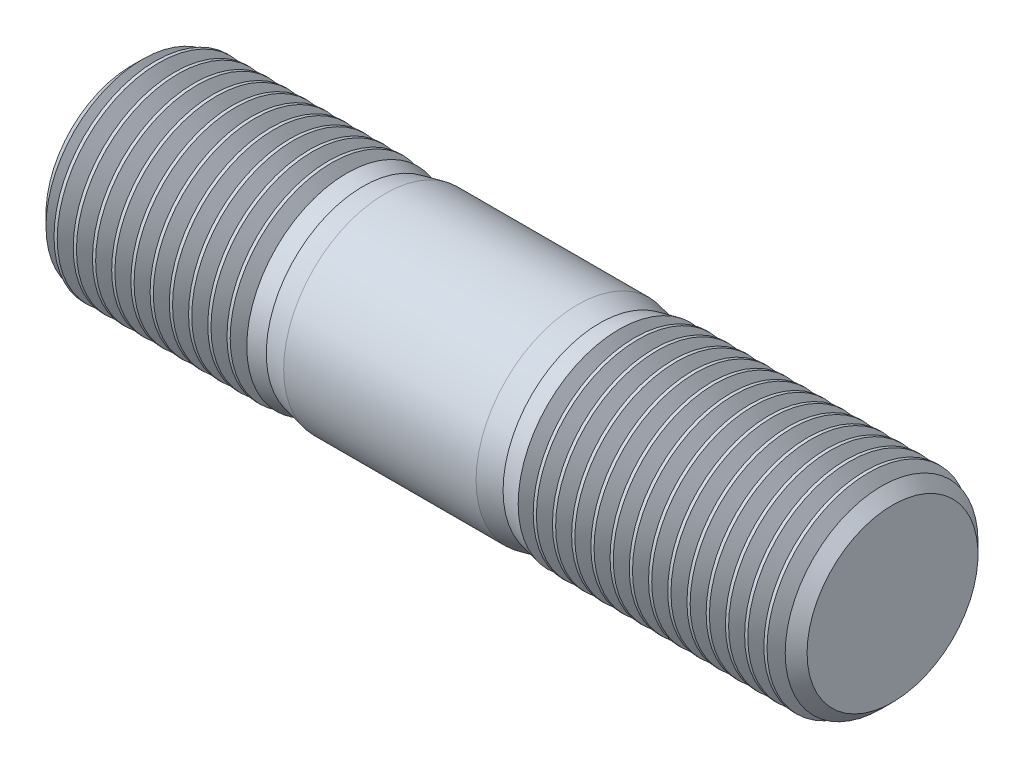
ISO-10303-21;
HEADER;
FILE_DESCRIPTION(('STEP AP214'),'2;1');
FILE_NAME('part.step','',(''),(''),'','','');
FILE_SCHEMA(('AUTOMOTIVE_DESIGN { 1 0 10303 214 1 1 1 1 }'));
ENDSEC;
DATA;
#1=APPLICATION_CONTEXT('core data for automotive mechanical design processes');
#2=APPLICATION_PROTOCOL_DEFINITION('international standard','automotive_design',2000,#1);
#3=PRODUCT_CONTEXT('',#1,'mechanical');
#4=PRODUCT('Part','Part','',(#3));
#5=PRODUCT_RELATED_PRODUCT_CATEGORY('part','',(#4));
#6=PRODUCT_DEFINITION_FORMATION('','',#4);
#7=PRODUCT_DEFINITION_CONTEXT('part definition',#1,'design');
#8=PRODUCT_DEFINITION('design','',#6,#7);
#9=PRODUCT_DEFINITION_SHAPE('','',#8);
#10=(LENGTH_UNIT() NAMED_UNIT(*) SI_UNIT(.MILLI.,.METRE.));
#11=(NAMED_UNIT(*) PLANE_ANGLE_UNIT() SI_UNIT($,.RADIAN.));
#12=(NAMED_UNIT(*) SI_UNIT($,.STERADIAN.) SOLID_ANGLE_UNIT());
#13=UNCERTAINTY_MEASURE_WITH_UNIT(LENGTH_MEASURE(1.E-05),#10,'distance_accuracy_value','');
#14=(GEOMETRIC_REPRESENTATION_CONTEXT(3) GLOBAL_UNCERTAINTY_ASSIGNED_CONTEXT((#13)) GLOBAL_UNIT_ASSIGNED_CONTEXT((#10,
#11,#12)) REPRESENTATION_CONTEXT('',''));
#15=CARTESIAN_POINT('',(0.,0.,0.));
#16=DIRECTION('',(0.,0.,1.));
#17=DIRECTION('',(1.,0.,0.));
#18=AXIS2_PLACEMENT_3D('',#15,#16,#17);
#19=CARTESIAN_POINT('',(15.,0.,0.));
#20=DIRECTION('',(-1.,0.,0.));
#21=DIRECTION('',(0.,0.,1.));
#22=AXIS2_PLACEMENT_3D('',#19,#20,#21);
#23=CONICAL_SURFACE('',#22,5.4315,0.213277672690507);
#24=CARTESIAN_POINT('',(13.6875,0.,0.));
#25=DIRECTION('',(1.,0.,0.));
#26=DIRECTION('',(0.,0.,-1.));
#27=AXIS2_PLACEMENT_3D('',#24,#25,#26);
#28=CIRCLE('',#27,5.71575);
#29=CARTESIAN_POINT('',(13.6875,0.,-5.71575));
#30=VERTEX_POINT('',#29);
#31=EDGE_CURVE('E10',#30,#30,#28,.T.);
#32=ORIENTED_EDGE('',*,*,#31,.F.);
#33=EDGE_LOOP('',(#32));
#34=FACE_BOUND('',#33,.T.);
#35=CARTESIAN_POINT('',(12.7389878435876,0.,0.));
#36=DIRECTION('',(1.,0.,0.));
#37=DIRECTION('',(0.,0.,-1.));
#38=AXIS2_PLACEMENT_3D('',#35,#36,#37);
#39=CIRCLE('',#38,5.92117063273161);
#40=CARTESIAN_POINT('',(12.7389878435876,0.,-5.92117063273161));
#41=VERTEX_POINT('',#40);
#42=EDGE_CURVE('E49',#41,#41,#39,.F.);
#43=ORIENTED_EDGE('',*,*,#42,.F.);
#44=EDGE_LOOP('',(#43));
#45=FACE_BOUND('',#44,.T.);
#46=ADVANCED_FACE('F45',(#34,#45),#23,.T.);
#47=CARTESIAN_POINT('',(-1.31084166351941,0.,0.));
#48=DIRECTION('',(-1.,0.,0.));
#49=DIRECTION('',(0.,0.,1.));
#50=AXIS2_PLACEMENT_3D('',#47,#48,#49);
#51=CYLINDRICAL_SURFACE('',#50,6.);
#52=CARTESIAN_POINT('',(29.9427,0.,0.));
#53=DIRECTION('',(-1.,0.,0.));
#54=DIRECTION('',(0.,0.,1.));
#55=AXIS2_PLACEMENT_3D('',#52,#53,#54);
#56=CIRCLE('',#55,6.);
#57=CARTESIAN_POINT('',(29.9427,0.,6.));
#58=VERTEX_POINT('',#57);
#59=EDGE_CURVE('E107',#58,#58,#56,.T.);
#60=ORIENTED_EDGE('',*,*,#59,.T.);
#61=EDGE_LOOP('',(#60));
#62=FACE_BOUND('',#61,.T.);
#63=CARTESIAN_POINT('',(29.7533,0.,0.));
#64=DIRECTION('',(-1.,0.,0.));
#65=DIRECTION('',(0.,0.,1.));
#66=AXIS2_PLACEMENT_3D('',#63,#64,#65);
#67=CIRCLE('',#66,6.);
#68=CARTESIAN_POINT('',(29.7533,0.,6.));
#69=VERTEX_POINT('',#68);
#70=EDGE_CURVE('E74',#69,#69,#67,.T.);
#71=ORIENTED_EDGE('',*,*,#70,.F.);
#72=EDGE_LOOP('',(#71));
#73=FACE_BOUND('',#72,.T.);
#74=ADVANCED_FACE('F287',(#62,#73),#51,.T.);
#75=CARTESIAN_POINT('',(31.0791,0.,0.));
#76=DIRECTION('',(-1.,0.,0.));
#77=DIRECTION('',(0.,0.,1.));
#78=AXIS2_PLACEMENT_3D('',#75,#76,#77);
#79=CIRCLE('',#78,6.);
#80=CARTESIAN_POINT('',(31.0791,0.,6.));
#81=VERTEX_POINT('',#80);
#82=EDGE_CURVE('E119',#81,#81,#79,.T.);
#83=ORIENTED_EDGE('',*,*,#82,.T.);
#84=EDGE_LOOP('',(#83));
#85=FACE_BOUND('',#84,.T.);
#86=CARTESIAN_POINT('',(30.8897,0.,0.));
#87=DIRECTION('',(-1.,0.,0.));
#88=DIRECTION('',(0.,0.,1.));
#89=AXIS2_PLACEMENT_3D('',#86,#87,#88);
#90=CIRCLE('',#89,6.);
#91=CARTESIAN_POINT('',(30.8897,0.,6.));
#92=VERTEX_POINT('',#91);
#93=EDGE_CURVE('E103',#92,#92,#90,.T.);
#94=ORIENTED_EDGE('',*,*,#93,.F.);
#95=EDGE_LOOP('',(#94));
#96=FACE_BOUND('',#95,.T.);
#97=ADVANCED_FACE('F458',(#85,#96),#51,.T.);
#98=CARTESIAN_POINT('',(32.2155,0.,0.));
#99=DIRECTION('',(-1.,0.,0.));
#100=DIRECTION('',(0.,0.,1.));
#101=AXIS2_PLACEMENT_3D('',#98,#99,#100);
#102=CIRCLE('',#101,6.);
#103=CARTESIAN_POINT('',(32.2155,0.,6.));
#104=VERTEX_POINT('',#103);
#105=EDGE_CURVE('E131',#104,#104,#102,.T.);
#106=ORIENTED_EDGE('',*,*,#105,.T.);
#107=EDGE_LOOP('',(#106));
#108=FACE_BOUND('',#107,.T.);
#109=CARTESIAN_POINT('',(32.0261,0.,0.));
#110=DIRECTION('',(-1.,0.,0.));
#111=DIRECTION('',(0.,0.,1.));
#112=AXIS2_PLACEMENT_3D('',#109,#110,#111);
#113=CIRCLE('',#112,6.);
#114=CARTESIAN_POINT('',(32.0261,0.,6.));
#115=VERTEX_POINT('',#114);
#116=EDGE_CURVE('E115',#115,#115,#113,.T.);
#117=ORIENTED_EDGE('',*,*,#116,.F.);
#118=EDGE_LOOP('',(#117));
#119=FACE_BOUND('',#118,.T.);
#120=ADVANCED_FACE('F441',(#108,#119),#51,.T.);
#121=CARTESIAN_POINT('',(33.3519,0.,0.));
#122=DIRECTION('',(-1.,0.,0.));
#123=DIRECTION('',(0.,0.,1.));
#124=AXIS2_PLACEMENT_3D('',#121,#122,#123);
#125=CIRCLE('',#124,6.);
#126=CARTESIAN_POINT('',(33.3519,0.,6.));
#127=VERTEX_POINT('',#126);
#128=EDGE_CURVE('E143',#127,#127,#125,.T.);
#129=ORIENTED_EDGE('',*,*,#128,.T.);
#130=EDGE_LOOP('',(#129));
#131=FACE_BOUND('',#130,.T.);
#132=CARTESIAN_POINT('',(33.1625,0.,0.));
#133=DIRECTION('',(-1.,0.,0.));
#134=DIRECTION('',(0.,0.,1.));
#135=AXIS2_PLACEMENT_3D('',#132,#133,#134);
#136=CIRCLE('',#135,6.);
#137=CARTESIAN_POINT('',(33.1625,0.,6.));
#138=VERTEX_POINT('',#137);
#139=EDGE_CURVE('E127',#138,#138,#136,.T.);
#140=ORIENTED_EDGE('',*,*,#139,.F.);
#141=EDGE_LOOP('',(#140));
#142=FACE_BOUND('',#141,.T.);
#143=ADVANCED_FACE('F424',(#131,#142),#51,.T.);
#144=CARTESIAN_POINT('',(34.4883,0.,0.));
#145=DIRECTION('',(-1.,0.,0.));
#146=DIRECTION('',(0.,0.,1.));
#147=AXIS2_PLACEMENT_3D('',#144,#145,#146);
#148=CIRCLE('',#147,6.);
#149=CARTESIAN_POINT('',(34.4883,0.,6.));
#150=VERTEX_POINT('',#149);
#151=EDGE_CURVE('E155',#150,#150,#148,.T.);
#152=ORIENTED_EDGE('',*,*,#151,.T.);
#153=EDGE_LOOP('',(#152));
#154=FACE_BOUND('',#153,.T.);
#155=CARTESIAN_POINT('',(34.2989,0.,0.));
#156=DIRECTION('',(-1.,0.,0.));
#157=DIRECTION('',(0.,0.,1.));
#158=AXIS2_PLACEMENT_3D('',#155,#156,#157);
#159=CIRCLE('',#158,6.);
#160=CARTESIAN_POINT('',(34.2989,0.,6.));
#161=VERTEX_POINT('',#160);
#162=EDGE_CURVE('E139',#161,#161,#159,.T.);
#163=ORIENTED_EDGE('',*,*,#162,.F.);
#164=EDGE_LOOP('',(#163));
#165=FACE_BOUND('',#164,.T.);
#166=ADVANCED_FACE('F407',(#154,#165),#51,.T.);
#167=CARTESIAN_POINT('',(35.6247,0.,0.));
#168=DIRECTION('',(-1.,0.,0.));
#169=DIRECTION('',(0.,0.,1.));
#170=AXIS2_PLACEMENT_3D('',#167,#168,#169);
#171=CIRCLE('',#170,6.);
#172=CARTESIAN_POINT('',(35.6247,0.,6.));
#173=VERTEX_POINT('',#172);
#174=EDGE_CURVE('E167',#173,#173,#171,.T.);
#175=ORIENTED_EDGE('',*,*,#174,.T.);
#176=EDGE_LOOP('',(#175));
#177=FACE_BOUND('',#176,.T.);
#178=CARTESIAN_POINT('',(35.4353,0.,0.));
#179=DIRECTION('',(-1.,0.,0.));
#180=DIRECTION('',(0.,0.,1.));
#181=AXIS2_PLACEMENT_3D('',#178,#179,#180);
#182=CIRCLE('',#181,6.);
#183=CARTESIAN_POINT('',(35.4353,0.,6.));
#184=VERTEX_POINT('',#183);
#185=EDGE_CURVE('E151',#184,#184,#182,.T.);
#186=ORIENTED_EDGE('',*,*,#185,.F.);
#187=EDGE_LOOP('',(#186));
#188=FACE_BOUND('',#187,.T.);
#189=ADVANCED_FACE('F390',(#177,#188),#51,.T.);
#190=CARTESIAN_POINT('',(36.7611,0.,0.));
#191=DIRECTION('',(-1.,0.,0.));
#192=DIRECTION('',(0.,0.,1.));
#193=AXIS2_PLACEMENT_3D('',#190,#191,#192);
#194=CIRCLE('',#193,6.);
#195=CARTESIAN_POINT('',(36.7611,0.,6.));
#196=VERTEX_POINT('',#195);
#197=EDGE_CURVE('E179',#196,#196,#194,.T.);
#198=ORIENTED_EDGE('',*,*,#197,.T.);
#199=EDGE_LOOP('',(#198));
#200=FACE_BOUND('',#199,.T.);
#201=CARTESIAN_POINT('',(36.5717,0.,0.));
#202=DIRECTION('',(-1.,0.,0.));
#203=DIRECTION('',(0.,0.,1.));
#204=AXIS2_PLACEMENT_3D('',#201,#202,#203);
#205=CIRCLE('',#204,6.);
#206=CARTESIAN_POINT('',(36.5717,0.,6.));
#207=VERTEX_POINT('',#206);
#208=EDGE_CURVE('E163',#207,#207,#205,.T.);
#209=ORIENTED_EDGE('',*,*,#208,.F.);
#210=EDGE_LOOP('',(#209));
#211=FACE_BOUND('',#210,.T.);
#212=ADVANCED_FACE('F373',(#200,#211),#51,.T.);
#213=CARTESIAN_POINT('',(37.8975,0.,0.));
#214=DIRECTION('',(-1.,0.,0.));
#215=DIRECTION('',(0.,0.,1.));
#216=AXIS2_PLACEMENT_3D('',#213,#214,#215);
#217=CIRCLE('',#216,6.);
#218=CARTESIAN_POINT('',(37.8975,0.,6.));
#219=VERTEX_POINT('',#218);
#220=EDGE_CURVE('E191',#219,#219,#217,.T.);
#221=ORIENTED_EDGE('',*,*,#220,.T.);
#222=EDGE_LOOP('',(#221));
#223=FACE_BOUND('',#222,.T.);
#224=CARTESIAN_POINT('',(37.7081,0.,0.));
#225=DIRECTION('',(-1.,0.,0.));
#226=DIRECTION('',(0.,0.,1.));
#227=AXIS2_PLACEMENT_3D('',#224,#225,#226);
#228=CIRCLE('',#227,6.);
#229=CARTESIAN_POINT('',(37.7081,0.,6.));
#230=VERTEX_POINT('',#229);
#231=EDGE_CURVE('E175',#230,#230,#228,.T.);
#232=ORIENTED_EDGE('',*,*,#231,.F.);
#233=EDGE_LOOP('',(#232));
#234=FACE_BOUND('',#233,.T.);
#235=ADVANCED_FACE('F356',(#223,#234),#51,.T.);
#236=CARTESIAN_POINT('',(39.0339,0.,0.));
#237=DIRECTION('',(-1.,0.,0.));
#238=DIRECTION('',(0.,0.,1.));
#239=AXIS2_PLACEMENT_3D('',#236,#237,#238);
#240=CIRCLE('',#239,6.);
#241=CARTESIAN_POINT('',(39.0339,0.,6.));
#242=VERTEX_POINT('',#241);
#243=EDGE_CURVE('E203',#242,#242,#240,.T.);
#244=ORIENTED_EDGE('',*,*,#243,.T.);
#245=EDGE_LOOP('',(#244));
#246=FACE_BOUND('',#245,.T.);
#247=CARTESIAN_POINT('',(38.8445,0.,0.));
#248=DIRECTION('',(-1.,0.,0.));
#249=DIRECTION('',(0.,0.,1.));
#250=AXIS2_PLACEMENT_3D('',#247,#248,#249);
#251=CIRCLE('',#250,6.);
#252=CARTESIAN_POINT('',(38.8445,0.,6.));
#253=VERTEX_POINT('',#252);
#254=EDGE_CURVE('E187',#253,#253,#251,.T.);
#255=ORIENTED_EDGE('',*,*,#254,.F.);
#256=EDGE_LOOP('',(#255));
#257=FACE_BOUND('',#256,.T.);
#258=ADVANCED_FACE('F339',(#246,#257),#51,.T.);
#259=CARTESIAN_POINT('',(40.1703,0.,0.));
#260=DIRECTION('',(-1.,0.,0.));
#261=DIRECTION('',(0.,0.,1.));
#262=AXIS2_PLACEMENT_3D('',#259,#260,#261);
#263=CIRCLE('',#262,6.);
#264=CARTESIAN_POINT('',(40.1703,0.,6.));
#265=VERTEX_POINT('',#264);
#266=EDGE_CURVE('E215',#265,#265,#263,.T.);
#267=ORIENTED_EDGE('',*,*,#266,.T.);
#268=EDGE_LOOP('',(#267));
#269=FACE_BOUND('',#268,.T.);
#270=CARTESIAN_POINT('',(39.9809,0.,0.));
#271=DIRECTION('',(-1.,0.,0.));
#272=DIRECTION('',(0.,0.,1.));
#273=AXIS2_PLACEMENT_3D('',#270,#271,#272);
#274=CIRCLE('',#273,6.);
#275=CARTESIAN_POINT('',(39.9809,0.,6.));
#276=VERTEX_POINT('',#275);
#277=EDGE_CURVE('E199',#276,#276,#274,.T.);
#278=ORIENTED_EDGE('',*,*,#277,.F.);
#279=EDGE_LOOP('',(#278));
#280=FACE_BOUND('',#279,.T.);
#281=ADVANCED_FACE('F322',(#269,#280),#51,.T.);
#282=CARTESIAN_POINT('',(41.3067,0.,0.));
#283=DIRECTION('',(-1.,0.,0.));
#284=DIRECTION('',(0.,0.,1.));
#285=AXIS2_PLACEMENT_3D('',#282,#283,#284);
#286=CIRCLE('',#285,6.);
#287=CARTESIAN_POINT('',(41.3067,0.,6.));
#288=VERTEX_POINT('',#287);
#289=EDGE_CURVE('E227',#288,#288,#286,.T.);
#290=ORIENTED_EDGE('',*,*,#289,.T.);
#291=EDGE_LOOP('',(#290));
#292=FACE_BOUND('',#291,.T.);
#293=CARTESIAN_POINT('',(41.1173,0.,0.));
#294=DIRECTION('',(-1.,0.,0.));
#295=DIRECTION('',(0.,0.,1.));
#296=AXIS2_PLACEMENT_3D('',#293,#294,#295);
#297=CIRCLE('',#296,6.);
#298=CARTESIAN_POINT('',(41.1173,0.,6.));
#299=VERTEX_POINT('',#298);
#300=EDGE_CURVE('E211',#299,#299,#297,.T.);
#301=ORIENTED_EDGE('',*,*,#300,.F.);
#302=EDGE_LOOP('',(#301));
#303=FACE_BOUND('',#302,.T.);
#304=ADVANCED_FACE('F305',(#292,#303),#51,.T.);
#305=CARTESIAN_POINT('',(41.3067,0.,0.));
#306=DIRECTION('',(-1.,0.,0.));
#307=DIRECTION('',(0.,0.,1.));
#308=AXIS2_PLACEMENT_3D('',#305,#306,#307);
#309=CONICAL_SURFACE('',#308,6.,1.0471975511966);
#310=CARTESIAN_POINT('',(41.7802,0.,0.));
#311=DIRECTION('',(-1.,0.,0.));
#312=DIRECTION('',(0.,0.,1.));
#313=AXIS2_PLACEMENT_3D('',#310,#311,#312);
#314=CIRCLE('',#313,5.17987394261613);
#315=CARTESIAN_POINT('',(41.7802,0.,5.17987394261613));
#316=VERTEX_POINT('',#315);
#317=EDGE_CURVE('E219',#316,#316,#314,.T.);
#318=ORIENTED_EDGE('',*,*,#317,.T.);
#319=EDGE_LOOP('',(#318));
#320=FACE_BOUND('',#319,.T.);
#321=ORIENTED_EDGE('',*,*,#289,.F.);
#322=EDGE_LOOP('',(#321));
#323=FACE_BOUND('',#322,.T.);
#324=ADVANCED_FACE('F311',(#320,#323),#309,.T.);
#325=CARTESIAN_POINT('',(41.7802,0.,0.));
#326=DIRECTION('',(1.,0.,0.));
#327=DIRECTION('',(0.,0.,-1.));
#328=AXIS2_PLACEMENT_3D('',#325,#326,#327);
#329=CONICAL_SURFACE('',#328,5.17987394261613,1.0471975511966);
#330=CARTESIAN_POINT('',(42.2537,0.,0.));
#331=DIRECTION('',(-1.,0.,0.));
#332=DIRECTION('',(0.,0.,1.));
#333=AXIS2_PLACEMENT_3D('',#330,#331,#332);
#334=CIRCLE('',#333,6.);
#335=CARTESIAN_POINT('',(42.2537,0.,6.));
#336=VERTEX_POINT('',#335);
#337=EDGE_CURVE('E223',#336,#336,#334,.T.);
#338=ORIENTED_EDGE('',*,*,#337,.T.);
#339=EDGE_LOOP('',(#338));
#340=FACE_BOUND('',#339,.T.);
#341=ORIENTED_EDGE('',*,*,#317,.F.);
#342=EDGE_LOOP('',(#341));
#343=FACE_BOUND('',#342,.T.);
#344=ADVANCED_FACE('F308',(#340,#343),#329,.T.);
#345=CARTESIAN_POINT('',(45.,6.,0.));
#346=DIRECTION('',(-1.,0.,0.));
#347=DIRECTION('',(0.,0.,1.));
#348=AXIS2_PLACEMENT_3D('',#345,#346,#347);
#349=PLANE('',#348);
#350=CARTESIAN_POINT('',(45.,0.,0.));
#351=DIRECTION('',(-1.,0.,0.));
#352=DIRECTION('',(0.,0.,1.));
#353=AXIS2_PLACEMENT_3D('',#350,#351,#352);
#354=CIRCLE('',#353,5.053);
#355=CARTESIAN_POINT('',(45.,0.,5.053));
#356=VERTEX_POINT('',#355);
#357=EDGE_CURVE('E60',#356,#356,#354,.F.);
#358=ORIENTED_EDGE('',*,*,#357,.T.);
#359=EDGE_LOOP('',(#358));
#360=FACE_BOUND('',#359,.T.);
#361=ADVANCED_FACE('F264',(#360),#349,.F.);
#362=CARTESIAN_POINT('',(44.053,0.,0.));
#363=DIRECTION('',(-1.,0.,0.));
#364=DIRECTION('',(0.,0.,1.));
#365=AXIS2_PLACEMENT_3D('',#362,#363,#364);
#366=CONICAL_SURFACE('',#365,6.,0.785398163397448);
#367=ORIENTED_EDGE('',*,*,#357,.F.);
#368=EDGE_LOOP('',(#367));
#369=FACE_BOUND('',#368,.T.);
#370=CARTESIAN_POINT('',(44.3531869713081,0.,0.));
#371=DIRECTION('',(1.,0.,0.));
#372=DIRECTION('',(0.,0.,-1.));
#373=AXIS2_PLACEMENT_3D('',#370,#371,#372);
#374=CIRCLE('',#373,5.69981302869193);
#375=CARTESIAN_POINT('',(44.3531869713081,0.,-5.69981302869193));
#376=VERTEX_POINT('',#375);
#377=EDGE_CURVE('E64',#376,#376,#374,.T.);
#378=ORIENTED_EDGE('',*,*,#377,.T.);
#379=EDGE_LOOP('',(#378));
#380=FACE_BOUND('',#379,.T.);
#381=ADVANCED_FACE('F47',(#369,#380),#366,.T.);
#382=CARTESIAN_POINT('',(44.053,0.,0.));
#383=DIRECTION('',(1.,0.,0.));
#384=DIRECTION('',(0.,0.,-1.));
#385=AXIS2_PLACEMENT_3D('',#382,#383,#384);
#386=CONICAL_SURFACE('',#385,5.17987394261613,1.0471975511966);
#387=ORIENTED_EDGE('',*,*,#377,.F.);
#388=EDGE_LOOP('',(#387));
#389=FACE_BOUND('',#388,.T.);
#390=CARTESIAN_POINT('',(44.053,0.,0.));
#391=DIRECTION('',(-1.,0.,0.));
#392=DIRECTION('',(0.,0.,1.));
#393=AXIS2_PLACEMENT_3D('',#390,#391,#392);
#394=CIRCLE('',#393,5.17987394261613);
#395=CARTESIAN_POINT('',(44.053,0.,5.17987394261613));
#396=VERTEX_POINT('',#395);
#397=EDGE_CURVE('E243',#396,#396,#394,.T.);
#398=ORIENTED_EDGE('',*,*,#397,.F.);
#399=EDGE_LOOP('',(#398));
#400=FACE_BOUND('',#399,.T.);
#401=ADVANCED_FACE('F268',(#389,#400),#386,.T.);
#402=CARTESIAN_POINT('',(43.5795,0.,0.));
#403=DIRECTION('',(-1.,0.,0.));
#404=DIRECTION('',(0.,0.,1.));
#405=AXIS2_PLACEMENT_3D('',#402,#403,#404);
#406=CONICAL_SURFACE('',#405,6.,1.0471975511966);
#407=ORIENTED_EDGE('',*,*,#397,.T.);
#408=EDGE_LOOP('',(#407));
#409=FACE_BOUND('',#408,.T.);
#410=CARTESIAN_POINT('',(43.5795,0.,0.));
#411=DIRECTION('',(-1.,0.,0.));
#412=DIRECTION('',(0.,0.,1.));
#413=AXIS2_PLACEMENT_3D('',#410,#411,#412);
#414=CIRCLE('',#413,6.);
#415=CARTESIAN_POINT('',(43.5795,0.,6.));
#416=VERTEX_POINT('',#415);
#417=EDGE_CURVE('E69',#416,#416,#414,.T.);
#418=ORIENTED_EDGE('',*,*,#417,.F.);
#419=EDGE_LOOP('',(#418));
#420=FACE_BOUND('',#419,.T.);
#421=ADVANCED_FACE('F273',(#409,#420),#406,.T.);
#422=ORIENTED_EDGE('',*,*,#417,.T.);
#423=EDGE_LOOP('',(#422));
#424=FACE_BOUND('',#423,.T.);
#425=CARTESIAN_POINT('',(43.3901,0.,0.));
#426=DIRECTION('',(-1.,0.,0.));
#427=DIRECTION('',(0.,0.,1.));
#428=AXIS2_PLACEMENT_3D('',#425,#426,#427);
#429=CIRCLE('',#428,6.);
#430=CARTESIAN_POINT('',(43.3901,0.,6.));
#431=VERTEX_POINT('',#430);
#432=EDGE_CURVE('E235',#431,#431,#429,.T.);
#433=ORIENTED_EDGE('',*,*,#432,.F.);
#434=EDGE_LOOP('',(#433));
#435=FACE_BOUND('',#434,.T.);
#436=ADVANCED_FACE('F279',(#424,#435),#51,.T.);
#437=CARTESIAN_POINT('',(42.9166,0.,0.));
#438=DIRECTION('',(1.,0.,0.));
#439=DIRECTION('',(0.,0.,-1.));
#440=AXIS2_PLACEMENT_3D('',#437,#438,#439);
#441=CONICAL_SURFACE('',#440,5.17987394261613,1.0471975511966);
#442=ORIENTED_EDGE('',*,*,#432,.T.);
#443=EDGE_LOOP('',(#442));
#444=FACE_BOUND('',#443,.T.);
#445=CARTESIAN_POINT('',(42.9166,0.,0.));
#446=DIRECTION('',(-1.,0.,0.));
#447=DIRECTION('',(0.,0.,1.));
#448=AXIS2_PLACEMENT_3D('',#445,#446,#447);
#449=CIRCLE('',#448,5.17987394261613);
#450=CARTESIAN_POINT('',(42.9166,0.,5.17987394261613));
#451=VERTEX_POINT('',#450);
#452=EDGE_CURVE('E231',#451,#451,#449,.T.);
#453=ORIENTED_EDGE('',*,*,#452,.F.);
#454=EDGE_LOOP('',(#453));
#455=FACE_BOUND('',#454,.T.);
#456=ADVANCED_FACE('F285',(#444,#455),#441,.T.);
#457=CARTESIAN_POINT('',(42.4431,0.,0.));
#458=DIRECTION('',(-1.,0.,0.));
#459=DIRECTION('',(0.,0.,1.));
#460=AXIS2_PLACEMENT_3D('',#457,#458,#459);
#461=CONICAL_SURFACE('',#460,6.,1.0471975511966);
#462=ORIENTED_EDGE('',*,*,#452,.T.);
#463=EDGE_LOOP('',(#462));
#464=FACE_BOUND('',#463,.T.);
#465=CARTESIAN_POINT('',(42.4431,0.,0.));
#466=DIRECTION('',(-1.,0.,0.));
#467=DIRECTION('',(0.,0.,1.));
#468=AXIS2_PLACEMENT_3D('',#465,#466,#467);
#469=CIRCLE('',#468,6.);
#470=CARTESIAN_POINT('',(42.4431,0.,6.));
#471=VERTEX_POINT('',#470);
#472=EDGE_CURVE('E239',#471,#471,#469,.T.);
#473=ORIENTED_EDGE('',*,*,#472,.F.);
#474=EDGE_LOOP('',(#473));
#475=FACE_BOUND('',#474,.T.);
#476=ADVANCED_FACE('F293',(#464,#475),#461,.T.);
#477=ORIENTED_EDGE('',*,*,#472,.T.);
#478=EDGE_LOOP('',(#477));
#479=FACE_BOUND('',#478,.T.);
#480=ORIENTED_EDGE('',*,*,#337,.F.);
#481=EDGE_LOOP('',(#480));
#482=FACE_BOUND('',#481,.T.);
#483=ADVANCED_FACE('F288',(#479,#482),#51,.T.);
#484=CARTESIAN_POINT('',(40.1703,0.,0.));
#485=DIRECTION('',(-1.,0.,0.));
#486=DIRECTION('',(0.,0.,1.));
#487=AXIS2_PLACEMENT_3D('',#484,#485,#486);
#488=CONICAL_SURFACE('',#487,6.,1.0471975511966);
#489=CARTESIAN_POINT('',(40.6438,0.,0.));
#490=DIRECTION('',(-1.,0.,0.));
#491=DIRECTION('',(0.,0.,1.));
#492=AXIS2_PLACEMENT_3D('',#489,#490,#491);
#493=CIRCLE('',#492,5.17987394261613);
#494=CARTESIAN_POINT('',(40.6438,0.,5.17987394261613));
#495=VERTEX_POINT('',#494);
#496=EDGE_CURVE('E207',#495,#495,#493,.T.);
#497=ORIENTED_EDGE('',*,*,#496,.T.);
#498=EDGE_LOOP('',(#497));
#499=FACE_BOUND('',#498,.T.);
#500=ORIENTED_EDGE('',*,*,#266,.F.);
#501=EDGE_LOOP('',(#500));
#502=FACE_BOUND('',#501,.T.);
#503=ADVANCED_FACE('F304',(#499,#502),#488,.T.);
#504=CARTESIAN_POINT('',(40.6438,0.,0.));
#505=DIRECTION('',(1.,0.,0.));
#506=DIRECTION('',(0.,0.,-1.));
#507=AXIS2_PLACEMENT_3D('',#504,#505,#506);
#508=CONICAL_SURFACE('',#507,5.17987394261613,1.0471975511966);
#509=ORIENTED_EDGE('',*,*,#300,.T.);
#510=EDGE_LOOP('',(#509));
#511=FACE_BOUND('',#510,.T.);
#512=ORIENTED_EDGE('',*,*,#496,.F.);
#513=EDGE_LOOP('',(#512));
#514=FACE_BOUND('',#513,.T.);
#515=ADVANCED_FACE('F325',(#511,#514),#508,.T.);
#516=CARTESIAN_POINT('',(39.0339,0.,0.));
#517=DIRECTION('',(-1.,0.,0.));
#518=DIRECTION('',(0.,0.,1.));
#519=AXIS2_PLACEMENT_3D('',#516,#517,#518);
#520=CONICAL_SURFACE('',#519,6.,1.0471975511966);
#521=CARTESIAN_POINT('',(39.5074,0.,0.));
#522=DIRECTION('',(-1.,0.,0.));
#523=DIRECTION('',(0.,0.,1.));
#524=AXIS2_PLACEMENT_3D('',#521,#522,#523);
#525=CIRCLE('',#524,5.17987394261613);
#526=CARTESIAN_POINT('',(39.5074,0.,5.17987394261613));
#527=VERTEX_POINT('',#526);
#528=EDGE_CURVE('E195',#527,#527,#525,.T.);
#529=ORIENTED_EDGE('',*,*,#528,.T.);
#530=EDGE_LOOP('',(#529));
#531=FACE_BOUND('',#530,.T.);
#532=ORIENTED_EDGE('',*,*,#243,.F.);
#533=EDGE_LOOP('',(#532));
#534=FACE_BOUND('',#533,.T.);
#535=ADVANCED_FACE('F328',(#531,#534),#520,.T.);
#536=CARTESIAN_POINT('',(39.5074,0.,0.));
#537=DIRECTION('',(1.,0.,0.));
#538=DIRECTION('',(0.,0.,-1.));
#539=AXIS2_PLACEMENT_3D('',#536,#537,#538);
#540=CONICAL_SURFACE('',#539,5.17987394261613,1.0471975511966);
#541=ORIENTED_EDGE('',*,*,#277,.T.);
#542=EDGE_LOOP('',(#541));
#543=FACE_BOUND('',#542,.T.);
#544=ORIENTED_EDGE('',*,*,#528,.F.);
#545=EDGE_LOOP('',(#544));
#546=FACE_BOUND('',#545,.T.);
#547=ADVANCED_FACE('F342',(#543,#546),#540,.T.);
#548=CARTESIAN_POINT('',(37.8975,0.,0.));
#549=DIRECTION('',(-1.,0.,0.));
#550=DIRECTION('',(0.,0.,1.));
#551=AXIS2_PLACEMENT_3D('',#548,#549,#550);
#552=CONICAL_SURFACE('',#551,6.,1.0471975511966);
#553=CARTESIAN_POINT('',(38.371,0.,0.));
#554=DIRECTION('',(-1.,0.,0.));
#555=DIRECTION('',(0.,0.,1.));
#556=AXIS2_PLACEMENT_3D('',#553,#554,#555);
#557=CIRCLE('',#556,5.17987394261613);
#558=CARTESIAN_POINT('',(38.371,0.,5.17987394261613));
#559=VERTEX_POINT('',#558);
#560=EDGE_CURVE('E183',#559,#559,#557,.T.);
#561=ORIENTED_EDGE('',*,*,#560,.T.);
#562=EDGE_LOOP('',(#561));
#563=FACE_BOUND('',#562,.T.);
#564=ORIENTED_EDGE('',*,*,#220,.F.);
#565=EDGE_LOOP('',(#564));
#566=FACE_BOUND('',#565,.T.);
#567=ADVANCED_FACE('F345',(#563,#566),#552,.T.);
#568=CARTESIAN_POINT('',(38.371,0.,0.));
#569=DIRECTION('',(1.,0.,0.));
#570=DIRECTION('',(0.,0.,-1.));
#571=AXIS2_PLACEMENT_3D('',#568,#569,#570);
#572=CONICAL_SURFACE('',#571,5.17987394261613,1.0471975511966);
#573=ORIENTED_EDGE('',*,*,#254,.T.);
#574=EDGE_LOOP('',(#573));
#575=FACE_BOUND('',#574,.T.);
#576=ORIENTED_EDGE('',*,*,#560,.F.);
#577=EDGE_LOOP('',(#576));
#578=FACE_BOUND('',#577,.T.);
#579=ADVANCED_FACE('F359',(#575,#578),#572,.T.);
#580=CARTESIAN_POINT('',(36.7611,0.,0.));
#581=DIRECTION('',(-1.,0.,0.));
#582=DIRECTION('',(0.,0.,1.));
#583=AXIS2_PLACEMENT_3D('',#580,#581,#582);
#584=CONICAL_SURFACE('',#583,6.,1.0471975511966);
#585=CARTESIAN_POINT('',(37.2346,0.,0.));
#586=DIRECTION('',(-1.,0.,0.));
#587=DIRECTION('',(0.,0.,1.));
#588=AXIS2_PLACEMENT_3D('',#585,#586,#587);
#589=CIRCLE('',#588,5.17987394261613);
#590=CARTESIAN_POINT('',(37.2346,0.,5.17987394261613));
#591=VERTEX_POINT('',#590);
#592=EDGE_CURVE('E171',#591,#591,#589,.T.);
#593=ORIENTED_EDGE('',*,*,#592,.T.);
#594=EDGE_LOOP('',(#593));
#595=FACE_BOUND('',#594,.T.);
#596=ORIENTED_EDGE('',*,*,#197,.F.);
#597=EDGE_LOOP('',(#596));
#598=FACE_BOUND('',#597,.T.);
#599=ADVANCED_FACE('F362',(#595,#598),#584,.T.);
#600=CARTESIAN_POINT('',(37.2346,0.,0.));
#601=DIRECTION('',(1.,0.,0.));
#602=DIRECTION('',(0.,0.,-1.));
#603=AXIS2_PLACEMENT_3D('',#600,#601,#602);
#604=CONICAL_SURFACE('',#603,5.17987394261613,1.0471975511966);
#605=ORIENTED_EDGE('',*,*,#231,.T.);
#606=EDGE_LOOP('',(#605));
#607=FACE_BOUND('',#606,.T.);
#608=ORIENTED_EDGE('',*,*,#592,.F.);
#609=EDGE_LOOP('',(#608));
#610=FACE_BOUND('',#609,.T.);
#611=ADVANCED_FACE('F376',(#607,#610),#604,.T.);
#612=CARTESIAN_POINT('',(35.6247,0.,0.));
#613=DIRECTION('',(-1.,0.,0.));
#614=DIRECTION('',(0.,0.,1.));
#615=AXIS2_PLACEMENT_3D('',#612,#613,#614);
#616=CONICAL_SURFACE('',#615,6.,1.0471975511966);
#617=CARTESIAN_POINT('',(36.0982,0.,0.));
#618=DIRECTION('',(-1.,0.,0.));
#619=DIRECTION('',(0.,0.,1.));
#620=AXIS2_PLACEMENT_3D('',#617,#618,#619);
#621=CIRCLE('',#620,5.17987394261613);
#622=CARTESIAN_POINT('',(36.0982,0.,5.17987394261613));
#623=VERTEX_POINT('',#622);
#624=EDGE_CURVE('E159',#623,#623,#621,.T.);
#625=ORIENTED_EDGE('',*,*,#624,.T.);
#626=EDGE_LOOP('',(#625));
#627=FACE_BOUND('',#626,.T.);
#628=ORIENTED_EDGE('',*,*,#174,.F.);
#629=EDGE_LOOP('',(#628));
#630=FACE_BOUND('',#629,.T.);
#631=ADVANCED_FACE('F379',(#627,#630),#616,.T.);
#632=CARTESIAN_POINT('',(36.0982,0.,0.));
#633=DIRECTION('',(1.,0.,0.));
#634=DIRECTION('',(0.,0.,-1.));
#635=AXIS2_PLACEMENT_3D('',#632,#633,#634);
#636=CONICAL_SURFACE('',#635,5.17987394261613,1.0471975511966);
#637=ORIENTED_EDGE('',*,*,#208,.T.);
#638=EDGE_LOOP('',(#637));
#639=FACE_BOUND('',#638,.T.);
#640=ORIENTED_EDGE('',*,*,#624,.F.);
#641=EDGE_LOOP('',(#640));
#642=FACE_BOUND('',#641,.T.);
#643=ADVANCED_FACE('F393',(#639,#642),#636,.T.);
#644=CARTESIAN_POINT('',(34.4883,0.,0.));
#645=DIRECTION('',(-1.,0.,0.));
#646=DIRECTION('',(0.,0.,1.));
#647=AXIS2_PLACEMENT_3D('',#644,#645,#646);
#648=CONICAL_SURFACE('',#647,6.,1.0471975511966);
#649=CARTESIAN_POINT('',(34.9618,0.,0.));
#650=DIRECTION('',(-1.,0.,0.));
#651=DIRECTION('',(0.,0.,1.));
#652=AXIS2_PLACEMENT_3D('',#649,#650,#651);
#653=CIRCLE('',#652,5.17987394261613);
#654=CARTESIAN_POINT('',(34.9618,0.,5.17987394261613));
#655=VERTEX_POINT('',#654);
#656=EDGE_CURVE('E147',#655,#655,#653,.T.);
#657=ORIENTED_EDGE('',*,*,#656,.T.);
#658=EDGE_LOOP('',(#657));
#659=FACE_BOUND('',#658,.T.);
#660=ORIENTED_EDGE('',*,*,#151,.F.);
#661=EDGE_LOOP('',(#660));
#662=FACE_BOUND('',#661,.T.);
#663=ADVANCED_FACE('F396',(#659,#662),#648,.T.);
#664=CARTESIAN_POINT('',(34.9618,0.,0.));
#665=DIRECTION('',(1.,0.,0.));
#666=DIRECTION('',(0.,0.,-1.));
#667=AXIS2_PLACEMENT_3D('',#664,#665,#666);
#668=CONICAL_SURFACE('',#667,5.17987394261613,1.0471975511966);
#669=ORIENTED_EDGE('',*,*,#185,.T.);
#670=EDGE_LOOP('',(#669));
#671=FACE_BOUND('',#670,.T.);
#672=ORIENTED_EDGE('',*,*,#656,.F.);
#673=EDGE_LOOP('',(#672));
#674=FACE_BOUND('',#673,.T.);
#675=ADVANCED_FACE('F410',(#671,#674),#668,.T.);
#676=CARTESIAN_POINT('',(33.3519,0.,0.));
#677=DIRECTION('',(-1.,0.,0.));
#678=DIRECTION('',(0.,0.,1.));
#679=AXIS2_PLACEMENT_3D('',#676,#677,#678);
#680=CONICAL_SURFACE('',#679,6.,1.0471975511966);
#681=CARTESIAN_POINT('',(33.8254,0.,0.));
#682=DIRECTION('',(-1.,0.,0.));
#683=DIRECTION('',(0.,0.,1.));
#684=AXIS2_PLACEMENT_3D('',#681,#682,#683);
#685=CIRCLE('',#684,5.17987394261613);
#686=CARTESIAN_POINT('',(33.8254,0.,5.17987394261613));
#687=VERTEX_POINT('',#686);
#688=EDGE_CURVE('E135',#687,#687,#685,.T.);
#689=ORIENTED_EDGE('',*,*,#688,.T.);
#690=EDGE_LOOP('',(#689));
#691=FACE_BOUND('',#690,.T.);
#692=ORIENTED_EDGE('',*,*,#128,.F.);
#693=EDGE_LOOP('',(#692));
#694=FACE_BOUND('',#693,.T.);
#695=ADVANCED_FACE('F413',(#691,#694),#680,.T.);
#696=CARTESIAN_POINT('',(33.8254,0.,0.));
#697=DIRECTION('',(1.,0.,0.));
#698=DIRECTION('',(0.,0.,-1.));
#699=AXIS2_PLACEMENT_3D('',#696,#697,#698);
#700=CONICAL_SURFACE('',#699,5.17987394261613,1.0471975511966);
#701=ORIENTED_EDGE('',*,*,#162,.T.);
#702=EDGE_LOOP('',(#701));
#703=FACE_BOUND('',#702,.T.);
#704=ORIENTED_EDGE('',*,*,#688,.F.);
#705=EDGE_LOOP('',(#704));
#706=FACE_BOUND('',#705,.T.);
#707=ADVANCED_FACE('F427',(#703,#706),#700,.T.);
#708=CARTESIAN_POINT('',(32.2155,0.,0.));
#709=DIRECTION('',(-1.,0.,0.));
#710=DIRECTION('',(0.,0.,1.));
#711=AXIS2_PLACEMENT_3D('',#708,#709,#710);
#712=CONICAL_SURFACE('',#711,6.,1.0471975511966);
#713=CARTESIAN_POINT('',(32.689,0.,0.));
#714=DIRECTION('',(-1.,0.,0.));
#715=DIRECTION('',(0.,0.,1.));
#716=AXIS2_PLACEMENT_3D('',#713,#714,#715);
#717=CIRCLE('',#716,5.17987394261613);
#718=CARTESIAN_POINT('',(32.689,0.,5.17987394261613));
#719=VERTEX_POINT('',#718);
#720=EDGE_CURVE('E123',#719,#719,#717,.T.);
#721=ORIENTED_EDGE('',*,*,#720,.T.);
#722=EDGE_LOOP('',(#721));
#723=FACE_BOUND('',#722,.T.);
#724=ORIENTED_EDGE('',*,*,#105,.F.);
#725=EDGE_LOOP('',(#724));
#726=FACE_BOUND('',#725,.T.);
#727=ADVANCED_FACE('F430',(#723,#726),#712,.T.);
#728=CARTESIAN_POINT('',(32.689,0.,0.));
#729=DIRECTION('',(1.,0.,0.));
#730=DIRECTION('',(0.,0.,-1.));
#731=AXIS2_PLACEMENT_3D('',#728,#729,#730);
#732=CONICAL_SURFACE('',#731,5.17987394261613,1.0471975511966);
#733=ORIENTED_EDGE('',*,*,#139,.T.);
#734=EDGE_LOOP('',(#733));
#735=FACE_BOUND('',#734,.T.);
#736=ORIENTED_EDGE('',*,*,#720,.F.);
#737=EDGE_LOOP('',(#736));
#738=FACE_BOUND('',#737,.T.);
#739=ADVANCED_FACE('F444',(#735,#738),#732,.T.);
#740=CARTESIAN_POINT('',(31.0791,0.,0.));
#741=DIRECTION('',(-1.,0.,0.));
#742=DIRECTION('',(0.,0.,1.));
#743=AXIS2_PLACEMENT_3D('',#740,#741,#742);
#744=CONICAL_SURFACE('',#743,6.,1.0471975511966);
#745=CARTESIAN_POINT('',(31.5526,0.,0.));
#746=DIRECTION('',(-1.,0.,0.));
#747=DIRECTION('',(0.,0.,1.));
#748=AXIS2_PLACEMENT_3D('',#745,#746,#747);
#749=CIRCLE('',#748,5.17987394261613);
#750=CARTESIAN_POINT('',(31.5526,0.,5.17987394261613));
#751=VERTEX_POINT('',#750);
#752=EDGE_CURVE('E111',#751,#751,#749,.T.);
#753=ORIENTED_EDGE('',*,*,#752,.T.);
#754=EDGE_LOOP('',(#753));
#755=FACE_BOUND('',#754,.T.);
#756=ORIENTED_EDGE('',*,*,#82,.F.);
#757=EDGE_LOOP('',(#756));
#758=FACE_BOUND('',#757,.T.);
#759=ADVANCED_FACE('F447',(#755,#758),#744,.T.);
#760=CARTESIAN_POINT('',(31.5526,0.,0.));
#761=DIRECTION('',(1.,0.,0.));
#762=DIRECTION('',(0.,0.,-1.));
#763=AXIS2_PLACEMENT_3D('',#760,#761,#762);
#764=CONICAL_SURFACE('',#763,5.17987394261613,1.0471975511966);
#765=ORIENTED_EDGE('',*,*,#116,.T.);
#766=EDGE_LOOP('',(#765));
#767=FACE_BOUND('',#766,.T.);
#768=ORIENTED_EDGE('',*,*,#752,.F.);
#769=EDGE_LOOP('',(#768));
#770=FACE_BOUND('',#769,.T.);
#771=ADVANCED_FACE('F461',(#767,#770),#764,.T.);
#772=CARTESIAN_POINT('',(29.9427,0.,0.));
#773=DIRECTION('',(-1.,0.,0.));
#774=DIRECTION('',(0.,0.,1.));
#775=AXIS2_PLACEMENT_3D('',#772,#773,#774);
#776=CONICAL_SURFACE('',#775,6.,1.0471975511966);
#777=CARTESIAN_POINT('',(30.4162,0.,0.));
#778=DIRECTION('',(-1.,0.,0.));
#779=DIRECTION('',(0.,0.,1.));
#780=AXIS2_PLACEMENT_3D('',#777,#778,#779);
#781=CIRCLE('',#780,5.17987394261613);
#782=CARTESIAN_POINT('',(30.4162,0.,5.17987394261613));
#783=VERTEX_POINT('',#782);
#784=EDGE_CURVE('E73',#783,#783,#781,.T.);
#785=ORIENTED_EDGE('',*,*,#784,.T.);
#786=EDGE_LOOP('',(#785));
#787=FACE_BOUND('',#786,.T.);
#788=ORIENTED_EDGE('',*,*,#59,.F.);
#789=EDGE_LOOP('',(#788));
#790=FACE_BOUND('',#789,.T.);
#791=ADVANCED_FACE('F464',(#787,#790),#776,.T.);
#792=CARTESIAN_POINT('',(30.4162,0.,0.));
#793=DIRECTION('',(1.,0.,0.));
#794=DIRECTION('',(0.,0.,-1.));
#795=AXIS2_PLACEMENT_3D('',#792,#793,#794);
#796=CONICAL_SURFACE('',#795,5.17987394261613,1.0471975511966);
#797=ORIENTED_EDGE('',*,*,#93,.T.);
#798=EDGE_LOOP('',(#797));
#799=FACE_BOUND('',#798,.T.);
#800=ORIENTED_EDGE('',*,*,#784,.F.);
#801=EDGE_LOOP('',(#800));
#802=FACE_BOUND('',#801,.T.);
#803=ADVANCED_FACE('F477',(#799,#802),#796,.T.);
#804=CARTESIAN_POINT('',(28.8063,0.,0.));
#805=DIRECTION('',(-1.,0.,0.));
#806=DIRECTION('',(0.,0.,1.));
#807=AXIS2_PLACEMENT_3D('',#804,#805,#806);
#808=CONICAL_SURFACE('',#807,6.,1.0471975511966);
#809=CARTESIAN_POINT('',(29.2798,0.,0.));
#810=DIRECTION('',(-1.,0.,0.));
#811=DIRECTION('',(0.,0.,1.));
#812=AXIS2_PLACEMENT_3D('',#809,#810,#811);
#813=CIRCLE('',#812,5.17987394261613);
#814=CARTESIAN_POINT('',(29.2798,0.,5.17987394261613));
#815=VERTEX_POINT('',#814);
#816=EDGE_CURVE('E78',#815,#815,#813,.T.);
#817=ORIENTED_EDGE('',*,*,#816,.T.);
#818=EDGE_LOOP('',(#817));
#819=FACE_BOUND('',#818,.T.);
#820=CARTESIAN_POINT('',(28.8278279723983,0.,0.));
#821=DIRECTION('',(-1.,0.,0.));
#822=DIRECTION('',(0.,0.,1.));
#823=AXIS2_PLACEMENT_3D('',#820,#821,#822);
#824=CIRCLE('',#823,5.96271245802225);
#825=CARTESIAN_POINT('',(28.8278279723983,0.,5.96271245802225));
#826=VERTEX_POINT('',#825);
#827=EDGE_CURVE('E70',#826,#826,#824,.F.);
#828=ORIENTED_EDGE('',*,*,#827,.T.);
#829=EDGE_LOOP('',(#828));
#830=FACE_BOUND('',#829,.T.);
#831=ADVANCED_FACE('F480',(#819,#830),#808,.T.);
#832=CARTESIAN_POINT('',(29.2798,0.,0.));
#833=DIRECTION('',(1.,0.,0.));
#834=DIRECTION('',(0.,0.,-1.));
#835=AXIS2_PLACEMENT_3D('',#832,#833,#834);
#836=CONICAL_SURFACE('',#835,5.17987394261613,1.0471975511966);
#837=ORIENTED_EDGE('',*,*,#70,.T.);
#838=EDGE_LOOP('',(#837));
#839=FACE_BOUND('',#838,.T.);
#840=ORIENTED_EDGE('',*,*,#816,.F.);
#841=EDGE_LOOP('',(#840));
#842=FACE_BOUND('',#841,.T.);
#843=ADVANCED_FACE('F493',(#839,#842),#836,.T.);
#844=CARTESIAN_POINT('',(15.,0.,0.));
#845=DIRECTION('',(1.,0.,0.));
#846=DIRECTION('',(0.,0.,-1.));
#847=AXIS2_PLACEMENT_3D('',#844,#845,#846);
#848=CONICAL_SURFACE('',#847,6.,0.213277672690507);
#849=CARTESIAN_POINT('',(15.,0.,0.));
#850=DIRECTION('',(-1.,0.,0.));
#851=DIRECTION('',(0.,0.,1.));
#852=AXIS2_PLACEMENT_3D('',#849,#850,#851);
#853=CIRCLE('',#852,6.);
#854=CARTESIAN_POINT('',(15.,0.,6.));
#855=VERTEX_POINT('',#854);
#856=EDGE_CURVE('E253',#855,#855,#853,.T.);
#857=ORIENTED_EDGE('',*,*,#856,.T.);
#858=EDGE_LOOP('',(#857));
#859=FACE_BOUND('',#858,.T.);
#860=ORIENTED_EDGE('',*,*,#31,.T.);
#861=EDGE_LOOP('',(#860));
#862=FACE_BOUND('',#861,.T.);
#863=ADVANCED_FACE('F496',(#859,#862),#848,.T.);
#864=CARTESIAN_POINT('',(-1.31084166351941,0.,0.));
#865=DIRECTION('',(-1.,0.,0.));
#866=DIRECTION('',(0.,0.,1.));
#867=AXIS2_PLACEMENT_3D('',#864,#865,#866);
#868=CYLINDRICAL_SURFACE('',#867,6.);
#869=ORIENTED_EDGE('',*,*,#856,.F.);
#870=EDGE_LOOP('',(#869));
#871=FACE_BOUND('',#870,.T.);
#872=CARTESIAN_POINT('',(26.375,0.,0.));
#873=DIRECTION('',(-1.,0.,0.));
#874=DIRECTION('',(0.,0.,1.));
#875=AXIS2_PLACEMENT_3D('',#872,#873,#874);
#876=CIRCLE('',#875,6.);
#877=CARTESIAN_POINT('',(26.375,0.,6.));
#878=VERTEX_POINT('',#877);
#879=EDGE_CURVE('E68',#878,#878,#876,.T.);
#880=ORIENTED_EDGE('',*,*,#879,.T.);
#881=EDGE_LOOP('',(#880));
#882=FACE_BOUND('',#881,.T.);
#883=ADVANCED_FACE('F519',(#871,#882),#868,.T.);
#884=CARTESIAN_POINT('',(29.,0.,0.));
#885=DIRECTION('',(-1.,0.,0.));
#886=DIRECTION('',(0.,0.,1.));
#887=AXIS2_PLACEMENT_3D('',#884,#885,#886);
#888=CONICAL_SURFACE('',#887,5.4315,0.213277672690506);
#889=ORIENTED_EDGE('',*,*,#879,.F.);
#890=EDGE_LOOP('',(#889));
#891=FACE_BOUND('',#890,.T.);
#892=CARTESIAN_POINT('',(27.6875,0.,0.));
#893=DIRECTION('',(-1.,0.,0.));
#894=DIRECTION('',(0.,0.,1.));
#895=AXIS2_PLACEMENT_3D('',#892,#893,#894);
#896=CIRCLE('',#895,5.71575);
#897=CARTESIAN_POINT('',(27.6875,0.,5.71575));
#898=VERTEX_POINT('',#897);
#899=EDGE_CURVE('E54',#898,#898,#896,.T.);
#900=ORIENTED_EDGE('',*,*,#899,.T.);
#901=EDGE_LOOP('',(#900));
#902=FACE_BOUND('',#901,.T.);
#903=ADVANCED_FACE('F508',(#891,#902),#888,.T.);
#904=CARTESIAN_POINT('',(29.,0.,0.));
#905=DIRECTION('',(1.,0.,0.));
#906=DIRECTION('',(0.,0.,-1.));
#907=AXIS2_PLACEMENT_3D('',#904,#905,#906);
#908=CONICAL_SURFACE('',#907,6.,0.213277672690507);
#909=ORIENTED_EDGE('',*,*,#899,.F.);
#910=EDGE_LOOP('',(#909));
#911=FACE_BOUND('',#910,.T.);
#912=ORIENTED_EDGE('',*,*,#827,.F.);
#913=EDGE_LOOP('',(#912));
#914=FACE_BOUND('',#913,.T.);
#915=ADVANCED_FACE('F505',(#911,#914),#908,.T.);
#916=CARTESIAN_POINT('',(12.311,0.,0.));
#917=DIRECTION('',(1.,0.,0.));
#918=DIRECTION('',(0.,0.,-1.));
#919=AXIS2_PLACEMENT_3D('',#916,#917,#918);
#920=CONICAL_SURFACE('',#919,5.17987394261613,1.0471975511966);
#921=CARTESIAN_POINT('',(12.311,0.,0.));
#922=DIRECTION('',(-1.,0.,0.));
#923=DIRECTION('',(0.,0.,1.));
#924=AXIS2_PLACEMENT_3D('',#921,#922,#923);
#925=CIRCLE('',#924,5.17987394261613);
#926=CARTESIAN_POINT('',(12.311,0.,5.17987394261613));
#927=VERTEX_POINT('',#926);
#928=EDGE_CURVE('E1257',#927,#927,#925,.T.);
#929=ORIENTED_EDGE('',*,*,#928,.F.);
#930=EDGE_LOOP('',(#929));
#931=FACE_BOUND('',#930,.T.);
#932=ORIENTED_EDGE('',*,*,#42,.T.);
#933=EDGE_LOOP('',(#932));
#934=FACE_BOUND('',#933,.T.);
#935=ADVANCED_FACE('F507',(#931,#934),#920,.T.);
#936=CARTESIAN_POINT('',(11.8375,0.,0.));
#937=DIRECTION('',(-1.,0.,0.));
#938=DIRECTION('',(0.,0.,1.));
#939=AXIS2_PLACEMENT_3D('',#936,#937,#938);
#940=CONICAL_SURFACE('',#939,6.,1.0471975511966);
#941=ORIENTED_EDGE('',*,*,#928,.T.);
#942=EDGE_LOOP('',(#941));
#943=FACE_BOUND('',#942,.T.);
#944=CARTESIAN_POINT('',(11.8375,0.,0.));
#945=DIRECTION('',(-1.,0.,0.));
#946=DIRECTION('',(0.,0.,1.));
#947=AXIS2_PLACEMENT_3D('',#944,#945,#946);
#948=CIRCLE('',#947,6.);
#949=CARTESIAN_POINT('',(11.8375,0.,6.));
#950=VERTEX_POINT('',#949);
#951=EDGE_CURVE('E1104',#950,#950,#948,.T.);
#952=ORIENTED_EDGE('',*,*,#951,.F.);
#953=EDGE_LOOP('',(#952));
#954=FACE_BOUND('',#953,.T.);
#955=ADVANCED_FACE('F515',(#943,#954),#940,.T.);
#956=CARTESIAN_POINT('',(0.,0.,0.));
#957=DIRECTION('',(1.,0.,0.));
#958=DIRECTION('',(0.,0.,-1.));
#959=AXIS2_PLACEMENT_3D('',#956,#957,#958);
#960=PLANE('',#959);
#961=CARTESIAN_POINT('',(0.,0.,0.));
#962=DIRECTION('',(1.,0.,0.));
#963=DIRECTION('',(0.,0.,-1.));
#964=AXIS2_PLACEMENT_3D('',#961,#962,#963);
#965=CIRCLE('',#964,5.05299999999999);
#966=CARTESIAN_POINT('',(0.,0.,-5.05299999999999));
#967=VERTEX_POINT('',#966);
#968=EDGE_CURVE('E257',#967,#967,#965,.F.);
#969=ORIENTED_EDGE('',*,*,#968,.T.);
#970=EDGE_LOOP('',(#969));
#971=FACE_BOUND('',#970,.T.);
#972=ADVANCED_FACE('F539',(#971),#960,.F.);
#973=CARTESIAN_POINT('',(0.,0.,0.));
#974=DIRECTION('',(1.,0.,0.));
#975=DIRECTION('',(0.,0.,-1.));
#976=AXIS2_PLACEMENT_3D('',#973,#974,#975);
#977=CONICAL_SURFACE('',#976,5.05299999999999,0.785398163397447);
#978=ORIENTED_EDGE('',*,*,#968,.F.);
#979=EDGE_LOOP('',(#978));
#980=FACE_BOUND('',#979,.T.);
#981=CARTESIAN_POINT('',(0.646813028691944,0.,0.));
#982=DIRECTION('',(-1.,0.,0.));
#983=DIRECTION('',(0.,0.,1.));
#984=AXIS2_PLACEMENT_3D('',#981,#982,#983);
#985=CIRCLE('',#984,5.69981302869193);
#986=CARTESIAN_POINT('',(0.646813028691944,0.,5.69981302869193));
#987=VERTEX_POINT('',#986);
#988=EDGE_CURVE('E75',#987,#987,#985,.T.);
#989=ORIENTED_EDGE('',*,*,#988,.T.);
#990=EDGE_LOOP('',(#989));
#991=FACE_BOUND('',#990,.T.);
#992=ADVANCED_FACE('F541',(#980,#991),#977,.T.);
#993=CARTESIAN_POINT('',(0.473500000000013,0.,0.));
#994=DIRECTION('',(-1.,0.,0.));
#995=DIRECTION('',(0.,0.,1.));
#996=AXIS2_PLACEMENT_3D('',#993,#994,#995);
#997=CONICAL_SURFACE('',#996,6.,1.0471975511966);
#998=ORIENTED_EDGE('',*,*,#988,.F.);
#999=EDGE_LOOP('',(#998));
#1000=FACE_BOUND('',#999,.T.);
#1001=CARTESIAN_POINT('',(0.947000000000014,0.,0.));
#1002=DIRECTION('',(-1.,0.,0.));
#1003=DIRECTION('',(0.,0.,1.));
#1004=AXIS2_PLACEMENT_3D('',#1001,#1002,#1003);
#1005=CIRCLE('',#1004,5.17987394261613);
#1006=CARTESIAN_POINT('',(0.947000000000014,0.,5.17987394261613));
#1007=VERTEX_POINT('',#1006);
#1008=EDGE_CURVE('E87',#1007,#1007,#1005,.T.);
#1009=ORIENTED_EDGE('',*,*,#1008,.T.);
#1010=EDGE_LOOP('',(#1009));
#1011=FACE_BOUND('',#1010,.T.);
#1012=ADVANCED_FACE('F543',(#1000,#1011),#997,.T.);
#1013=CARTESIAN_POINT('',(0.947000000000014,0.,0.));
#1014=DIRECTION('',(1.,0.,0.));
#1015=DIRECTION('',(0.,0.,-1.));
#1016=AXIS2_PLACEMENT_3D('',#1013,#1014,#1015);
#1017=CONICAL_SURFACE('',#1016,5.17987394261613,1.0471975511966);
#1018=CARTESIAN_POINT('',(1.42050000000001,0.,0.));
#1019=DIRECTION('',(-1.,0.,0.));
#1020=DIRECTION('',(0.,0.,1.));
#1021=AXIS2_PLACEMENT_3D('',#1018,#1019,#1020);
#1022=CIRCLE('',#1021,6.);
#1023=CARTESIAN_POINT('',(1.42050000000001,0.,6.));
#1024=VERTEX_POINT('',#1023);
#1025=EDGE_CURVE('E79',#1024,#1024,#1022,.T.);
#1026=ORIENTED_EDGE('',*,*,#1025,.T.);
#1027=EDGE_LOOP('',(#1026));
#1028=FACE_BOUND('',#1027,.T.);
#1029=ORIENTED_EDGE('',*,*,#1008,.F.);
#1030=EDGE_LOOP('',(#1029));
#1031=FACE_BOUND('',#1030,.T.);
#1032=ADVANCED_FACE('F535',(#1028,#1031),#1017,.T.);
#1033=CARTESIAN_POINT('',(-1.31084166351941,0.,0.));
#1034=DIRECTION('',(-1.,0.,0.));
#1035=DIRECTION('',(0.,0.,1.));
#1036=AXIS2_PLACEMENT_3D('',#1033,#1034,#1035);
#1037=CYLINDRICAL_SURFACE('',#1036,6.);
#1038=ORIENTED_EDGE('',*,*,#1025,.F.);
#1039=EDGE_LOOP('',(#1038));
#1040=FACE_BOUND('',#1039,.T.);
#1041=CARTESIAN_POINT('',(1.60990000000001,0.,0.));
#1042=DIRECTION('',(-1.,0.,0.));
#1043=DIRECTION('',(0.,0.,1.));
#1044=AXIS2_PLACEMENT_3D('',#1041,#1042,#1043);
#1045=CIRCLE('',#1044,6.);
#1046=CARTESIAN_POINT('',(1.60990000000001,0.,6.));
#1047=VERTEX_POINT('',#1046);
#1048=EDGE_CURVE('E93',#1047,#1047,#1045,.T.);
#1049=ORIENTED_EDGE('',*,*,#1048,.T.);
#1050=EDGE_LOOP('',(#1049));
#1051=FACE_BOUND('',#1050,.T.);
#1052=ADVANCED_FACE('F531',(#1040,#1051),#1037,.T.);
#1053=CARTESIAN_POINT('',(1.60990000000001,0.,0.));
#1054=DIRECTION('',(-1.,0.,0.));
#1055=DIRECTION('',(0.,0.,1.));
#1056=AXIS2_PLACEMENT_3D('',#1053,#1054,#1055);
#1057=CONICAL_SURFACE('',#1056,6.,1.0471975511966);
#1058=CARTESIAN_POINT('',(2.08340000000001,0.,0.));
#1059=DIRECTION('',(-1.,0.,0.));
#1060=DIRECTION('',(0.,0.,1.));
#1061=AXIS2_PLACEMENT_3D('',#1058,#1059,#1060);
#1062=CIRCLE('',#1061,5.17987394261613);
#1063=CARTESIAN_POINT('',(2.08340000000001,0.,5.17987394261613));
#1064=VERTEX_POINT('',#1063);
#1065=EDGE_CURVE('E1195',#1064,#1064,#1062,.T.);
#1066=ORIENTED_EDGE('',*,*,#1065,.T.);
#1067=EDGE_LOOP('',(#1066));
#1068=FACE_BOUND('',#1067,.T.);
#1069=ORIENTED_EDGE('',*,*,#1048,.F.);
#1070=EDGE_LOOP('',(#1069));
#1071=FACE_BOUND('',#1070,.T.);
#1072=ADVANCED_FACE('F534',(#1068,#1071),#1057,.T.);
#1073=CARTESIAN_POINT('',(2.08340000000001,0.,0.));
#1074=DIRECTION('',(1.,0.,0.));
#1075=DIRECTION('',(0.,0.,-1.));
#1076=AXIS2_PLACEMENT_3D('',#1073,#1074,#1075);
#1077=CONICAL_SURFACE('',#1076,5.17987394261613,1.0471975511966);
#1078=CARTESIAN_POINT('',(2.55690000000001,0.,0.));
#1079=DIRECTION('',(-1.,0.,0.));
#1080=DIRECTION('',(0.,0.,1.));
#1081=AXIS2_PLACEMENT_3D('',#1078,#1079,#1080);
#1082=CIRCLE('',#1081,6.);
#1083=CARTESIAN_POINT('',(2.55690000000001,0.,6.));
#1084=VERTEX_POINT('',#1083);
#1085=EDGE_CURVE('E1199',#1084,#1084,#1082,.T.);
#1086=ORIENTED_EDGE('',*,*,#1085,.T.);
#1087=EDGE_LOOP('',(#1086));
#1088=FACE_BOUND('',#1087,.T.);
#1089=ORIENTED_EDGE('',*,*,#1065,.F.);
#1090=EDGE_LOOP('',(#1089));
#1091=FACE_BOUND('',#1090,.T.);
#1092=ADVANCED_FACE('F825',(#1088,#1091),#1077,.T.);
#1093=ORIENTED_EDGE('',*,*,#1085,.F.);
#1094=EDGE_LOOP('',(#1093));
#1095=FACE_BOUND('',#1094,.T.);
#1096=CARTESIAN_POINT('',(2.74630000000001,0.,0.));
#1097=DIRECTION('',(-1.,0.,0.));
#1098=DIRECTION('',(0.,0.,1.));
#1099=AXIS2_PLACEMENT_3D('',#1096,#1097,#1098);
#1100=CIRCLE('',#1099,6.);
#1101=CARTESIAN_POINT('',(2.74630000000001,0.,6.));
#1102=VERTEX_POINT('',#1101);
#1103=EDGE_CURVE('E1191',#1102,#1102,#1100,.T.);
#1104=ORIENTED_EDGE('',*,*,#1103,.T.);
#1105=EDGE_LOOP('',(#1104));
#1106=FACE_BOUND('',#1105,.T.);
#1107=ADVANCED_FACE('F538',(#1095,#1106),#1037,.T.);
#1108=CARTESIAN_POINT('',(2.74630000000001,0.,0.));
#1109=DIRECTION('',(-1.,0.,0.));
#1110=DIRECTION('',(0.,0.,1.));
#1111=AXIS2_PLACEMENT_3D('',#1108,#1109,#1110);
#1112=CONICAL_SURFACE('',#1111,6.,1.0471975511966);
#1113=CARTESIAN_POINT('',(3.21980000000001,0.,0.));
#1114=DIRECTION('',(-1.,0.,0.));
#1115=DIRECTION('',(0.,0.,1.));
#1116=AXIS2_PLACEMENT_3D('',#1113,#1114,#1115);
#1117=CIRCLE('',#1116,5.17987394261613);
#1118=CARTESIAN_POINT('',(3.21980000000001,0.,5.17987394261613));
#1119=VERTEX_POINT('',#1118);
#1120=EDGE_CURVE('E1183',#1119,#1119,#1117,.T.);
#1121=ORIENTED_EDGE('',*,*,#1120,.T.);
#1122=EDGE_LOOP('',(#1121));
#1123=FACE_BOUND('',#1122,.T.);
#1124=ORIENTED_EDGE('',*,*,#1103,.F.);
#1125=EDGE_LOOP('',(#1124));
#1126=FACE_BOUND('',#1125,.T.);
#1127=ADVANCED_FACE('F824',(#1123,#1126),#1112,.T.);
#1128=CARTESIAN_POINT('',(3.21980000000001,0.,0.));
#1129=DIRECTION('',(1.,0.,0.));
#1130=DIRECTION('',(0.,0.,-1.));
#1131=AXIS2_PLACEMENT_3D('',#1128,#1129,#1130);
#1132=CONICAL_SURFACE('',#1131,5.17987394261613,1.0471975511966);
#1133=CARTESIAN_POINT('',(3.69330000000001,0.,0.));
#1134=DIRECTION('',(-1.,0.,0.));
#1135=DIRECTION('',(0.,0.,1.));
#1136=AXIS2_PLACEMENT_3D('',#1133,#1134,#1135);
#1137=CIRCLE('',#1136,6.);
#1138=CARTESIAN_POINT('',(3.69330000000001,0.,6.));
#1139=VERTEX_POINT('',#1138);
#1140=EDGE_CURVE('E1187',#1139,#1139,#1137,.T.);
#1141=ORIENTED_EDGE('',*,*,#1140,.T.);
#1142=EDGE_LOOP('',(#1141));
#1143=FACE_BOUND('',#1142,.T.);
#1144=ORIENTED_EDGE('',*,*,#1120,.F.);
#1145=EDGE_LOOP('',(#1144));
#1146=FACE_BOUND('',#1145,.T.);
#1147=ADVANCED_FACE('F835',(#1143,#1146),#1132,.T.);
#1148=ORIENTED_EDGE('',*,*,#1140,.F.);
#1149=EDGE_LOOP('',(#1148));
#1150=FACE_BOUND('',#1149,.T.);
#1151=CARTESIAN_POINT('',(3.88270000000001,0.,0.));
#1152=DIRECTION('',(-1.,0.,0.));
#1153=DIRECTION('',(0.,0.,1.));
#1154=AXIS2_PLACEMENT_3D('',#1151,#1152,#1153);
#1155=CIRCLE('',#1154,6.);
#1156=CARTESIAN_POINT('',(3.88270000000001,0.,6.));
#1157=VERTEX_POINT('',#1156);
#1158=EDGE_CURVE('E1179',#1157,#1157,#1155,.T.);
#1159=ORIENTED_EDGE('',*,*,#1158,.T.);
#1160=EDGE_LOOP('',(#1159));
#1161=FACE_BOUND('',#1160,.T.);
#1162=ADVANCED_FACE('F827',(#1150,#1161),#1037,.T.);
#1163=CARTESIAN_POINT('',(3.88270000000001,0.,0.));
#1164=DIRECTION('',(-1.,0.,0.));
#1165=DIRECTION('',(0.,0.,1.));
#1166=AXIS2_PLACEMENT_3D('',#1163,#1164,#1165);
#1167=CONICAL_SURFACE('',#1166,6.,1.0471975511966);
#1168=CARTESIAN_POINT('',(4.35620000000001,0.,0.));
#1169=DIRECTION('',(-1.,0.,0.));
#1170=DIRECTION('',(0.,0.,1.));
#1171=AXIS2_PLACEMENT_3D('',#1168,#1169,#1170);
#1172=CIRCLE('',#1171,5.17987394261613);
#1173=CARTESIAN_POINT('',(4.35620000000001,0.,5.17987394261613));
#1174=VERTEX_POINT('',#1173);
#1175=EDGE_CURVE('E1171',#1174,#1174,#1172,.T.);
#1176=ORIENTED_EDGE('',*,*,#1175,.T.);
#1177=EDGE_LOOP('',(#1176));
#1178=FACE_BOUND('',#1177,.T.);
#1179=ORIENTED_EDGE('',*,*,#1158,.F.);
#1180=EDGE_LOOP('',(#1179));
#1181=FACE_BOUND('',#1180,.T.);
#1182=ADVANCED_FACE('F834',(#1178,#1181),#1167,.T.);
#1183=CARTESIAN_POINT('',(4.35620000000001,0.,0.));
#1184=DIRECTION('',(1.,0.,0.));
#1185=DIRECTION('',(0.,0.,-1.));
#1186=AXIS2_PLACEMENT_3D('',#1183,#1184,#1185);
#1187=CONICAL_SURFACE('',#1186,5.17987394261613,1.0471975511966);
#1188=CARTESIAN_POINT('',(4.82970000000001,0.,0.));
#1189=DIRECTION('',(-1.,0.,0.));
#1190=DIRECTION('',(0.,0.,1.));
#1191=AXIS2_PLACEMENT_3D('',#1188,#1189,#1190);
#1192=CIRCLE('',#1191,6.);
#1193=CARTESIAN_POINT('',(4.82970000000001,0.,6.));
#1194=VERTEX_POINT('',#1193);
#1195=EDGE_CURVE('E1175',#1194,#1194,#1192,.T.);
#1196=ORIENTED_EDGE('',*,*,#1195,.T.);
#1197=EDGE_LOOP('',(#1196));
#1198=FACE_BOUND('',#1197,.T.);
#1199=ORIENTED_EDGE('',*,*,#1175,.F.);
#1200=EDGE_LOOP('',(#1199));
#1201=FACE_BOUND('',#1200,.T.);
#1202=ADVANCED_FACE('F848',(#1198,#1201),#1187,.T.);
#1203=ORIENTED_EDGE('',*,*,#1195,.F.);
#1204=EDGE_LOOP('',(#1203));
#1205=FACE_BOUND('',#1204,.T.);
#1206=CARTESIAN_POINT('',(5.01910000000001,0.,0.));
#1207=DIRECTION('',(-1.,0.,0.));
#1208=DIRECTION('',(0.,0.,1.));
#1209=AXIS2_PLACEMENT_3D('',#1206,#1207,#1208);
#1210=CIRCLE('',#1209,6.);
#1211=CARTESIAN_POINT('',(5.01910000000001,0.,6.));
#1212=VERTEX_POINT('',#1211);
#1213=EDGE_CURVE('E1167',#1212,#1212,#1210,.T.);
#1214=ORIENTED_EDGE('',*,*,#1213,.T.);
#1215=EDGE_LOOP('',(#1214));
#1216=FACE_BOUND('',#1215,.T.);
#1217=ADVANCED_FACE('F837',(#1205,#1216),#1037,.T.);
#1218=CARTESIAN_POINT('',(5.01910000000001,0.,0.));
#1219=DIRECTION('',(-1.,0.,0.));
#1220=DIRECTION('',(0.,0.,1.));
#1221=AXIS2_PLACEMENT_3D('',#1218,#1219,#1220);
#1222=CONICAL_SURFACE('',#1221,6.,1.0471975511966);
#1223=CARTESIAN_POINT('',(5.49260000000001,0.,0.));
#1224=DIRECTION('',(-1.,0.,0.));
#1225=DIRECTION('',(0.,0.,1.));
#1226=AXIS2_PLACEMENT_3D('',#1223,#1224,#1225);
#1227=CIRCLE('',#1226,5.17987394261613);
#1228=CARTESIAN_POINT('',(5.49260000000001,0.,5.17987394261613));
#1229=VERTEX_POINT('',#1228);
#1230=EDGE_CURVE('E1159',#1229,#1229,#1227,.T.);
#1231=ORIENTED_EDGE('',*,*,#1230,.T.);
#1232=EDGE_LOOP('',(#1231));
#1233=FACE_BOUND('',#1232,.T.);
#1234=ORIENTED_EDGE('',*,*,#1213,.F.);
#1235=EDGE_LOOP('',(#1234));
#1236=FACE_BOUND('',#1235,.T.);
#1237=ADVANCED_FACE('F847',(#1233,#1236),#1222,.T.);
#1238=CARTESIAN_POINT('',(5.49260000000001,0.,0.));
#1239=DIRECTION('',(1.,0.,0.));
#1240=DIRECTION('',(0.,0.,-1.));
#1241=AXIS2_PLACEMENT_3D('',#1238,#1239,#1240);
#1242=CONICAL_SURFACE('',#1241,5.17987394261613,1.0471975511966);
#1243=CARTESIAN_POINT('',(5.96610000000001,0.,0.));
#1244=DIRECTION('',(-1.,0.,0.));
#1245=DIRECTION('',(0.,0.,1.));
#1246=AXIS2_PLACEMENT_3D('',#1243,#1244,#1245);
#1247=CIRCLE('',#1246,6.);
#1248=CARTESIAN_POINT('',(5.96610000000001,0.,6.));
#1249=VERTEX_POINT('',#1248);
#1250=EDGE_CURVE('E1163',#1249,#1249,#1247,.T.);
#1251=ORIENTED_EDGE('',*,*,#1250,.T.);
#1252=EDGE_LOOP('',(#1251));
#1253=FACE_BOUND('',#1252,.T.);
#1254=ORIENTED_EDGE('',*,*,#1230,.F.);
#1255=EDGE_LOOP('',(#1254));
#1256=FACE_BOUND('',#1255,.T.);
#1257=ADVANCED_FACE('F858',(#1253,#1256),#1242,.T.);
#1258=ORIENTED_EDGE('',*,*,#1250,.F.);
#1259=EDGE_LOOP('',(#1258));
#1260=FACE_BOUND('',#1259,.T.);
#1261=CARTESIAN_POINT('',(6.15550000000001,0.,0.));
#1262=DIRECTION('',(-1.,0.,0.));
#1263=DIRECTION('',(0.,0.,1.));
#1264=AXIS2_PLACEMENT_3D('',#1261,#1262,#1263);
#1265=CIRCLE('',#1264,6.);
#1266=CARTESIAN_POINT('',(6.15550000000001,0.,6.));
#1267=VERTEX_POINT('',#1266);
#1268=EDGE_CURVE('E1155',#1267,#1267,#1265,.T.);
#1269=ORIENTED_EDGE('',*,*,#1268,.T.);
#1270=EDGE_LOOP('',(#1269));
#1271=FACE_BOUND('',#1270,.T.);
#1272=ADVANCED_FACE('F850',(#1260,#1271),#1037,.T.);
#1273=CARTESIAN_POINT('',(6.15550000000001,0.,0.));
#1274=DIRECTION('',(-1.,0.,0.));
#1275=DIRECTION('',(0.,0.,1.));
#1276=AXIS2_PLACEMENT_3D('',#1273,#1274,#1275);
#1277=CONICAL_SURFACE('',#1276,6.,1.0471975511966);
#1278=CARTESIAN_POINT('',(6.62900000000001,0.,0.));
#1279=DIRECTION('',(-1.,0.,0.));
#1280=DIRECTION('',(0.,0.,1.));
#1281=AXIS2_PLACEMENT_3D('',#1278,#1279,#1280);
#1282=CIRCLE('',#1281,5.17987394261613);
#1283=CARTESIAN_POINT('',(6.62900000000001,0.,5.17987394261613));
#1284=VERTEX_POINT('',#1283);
#1285=EDGE_CURVE('E1147',#1284,#1284,#1282,.T.);
#1286=ORIENTED_EDGE('',*,*,#1285,.T.);
#1287=EDGE_LOOP('',(#1286));
#1288=FACE_BOUND('',#1287,.T.);
#1289=ORIENTED_EDGE('',*,*,#1268,.F.);
#1290=EDGE_LOOP('',(#1289));
#1291=FACE_BOUND('',#1290,.T.);
#1292=ADVANCED_FACE('F857',(#1288,#1291),#1277,.T.);
#1293=CARTESIAN_POINT('',(6.62900000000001,0.,0.));
#1294=DIRECTION('',(1.,0.,0.));
#1295=DIRECTION('',(0.,0.,-1.));
#1296=AXIS2_PLACEMENT_3D('',#1293,#1294,#1295);
#1297=CONICAL_SURFACE('',#1296,5.17987394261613,1.0471975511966);
#1298=CARTESIAN_POINT('',(7.10250000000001,0.,0.));
#1299=DIRECTION('',(-1.,0.,0.));
#1300=DIRECTION('',(0.,0.,1.));
#1301=AXIS2_PLACEMENT_3D('',#1298,#1299,#1300);
#1302=CIRCLE('',#1301,6.);
#1303=CARTESIAN_POINT('',(7.10250000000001,0.,6.));
#1304=VERTEX_POINT('',#1303);
#1305=EDGE_CURVE('E1151',#1304,#1304,#1302,.T.);
#1306=ORIENTED_EDGE('',*,*,#1305,.T.);
#1307=EDGE_LOOP('',(#1306));
#1308=FACE_BOUND('',#1307,.T.);
#1309=ORIENTED_EDGE('',*,*,#1285,.F.);
#1310=EDGE_LOOP('',(#1309));
#1311=FACE_BOUND('',#1310,.T.);
#1312=ADVANCED_FACE('F871',(#1308,#1311),#1297,.T.);
#1313=ORIENTED_EDGE('',*,*,#1305,.F.);
#1314=EDGE_LOOP('',(#1313));
#1315=FACE_BOUND('',#1314,.T.);
#1316=CARTESIAN_POINT('',(7.29190000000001,0.,0.));
#1317=DIRECTION('',(-1.,0.,0.));
#1318=DIRECTION('',(0.,0.,1.));
#1319=AXIS2_PLACEMENT_3D('',#1316,#1317,#1318);
#1320=CIRCLE('',#1319,6.);
#1321=CARTESIAN_POINT('',(7.29190000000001,0.,6.));
#1322=VERTEX_POINT('',#1321);
#1323=EDGE_CURVE('E1143',#1322,#1322,#1320,.T.);
#1324=ORIENTED_EDGE('',*,*,#1323,.T.);
#1325=EDGE_LOOP('',(#1324));
#1326=FACE_BOUND('',#1325,.T.);
#1327=ADVANCED_FACE('F860',(#1315,#1326),#1037,.T.);
#1328=CARTESIAN_POINT('',(7.29190000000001,0.,0.));
#1329=DIRECTION('',(-1.,0.,0.));
#1330=DIRECTION('',(0.,0.,1.));
#1331=AXIS2_PLACEMENT_3D('',#1328,#1329,#1330);
#1332=CONICAL_SURFACE('',#1331,6.,1.0471975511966);
#1333=CARTESIAN_POINT('',(7.76540000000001,0.,0.));
#1334=DIRECTION('',(-1.,0.,0.));
#1335=DIRECTION('',(0.,0.,1.));
#1336=AXIS2_PLACEMENT_3D('',#1333,#1334,#1335);
#1337=CIRCLE('',#1336,5.17987394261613);
#1338=CARTESIAN_POINT('',(7.76540000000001,0.,5.17987394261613));
#1339=VERTEX_POINT('',#1338);
#1340=EDGE_CURVE('E1135',#1339,#1339,#1337,.T.);
#1341=ORIENTED_EDGE('',*,*,#1340,.T.);
#1342=EDGE_LOOP('',(#1341));
#1343=FACE_BOUND('',#1342,.T.);
#1344=ORIENTED_EDGE('',*,*,#1323,.F.);
#1345=EDGE_LOOP('',(#1344));
#1346=FACE_BOUND('',#1345,.T.);
#1347=ADVANCED_FACE('F870',(#1343,#1346),#1332,.T.);
#1348=CARTESIAN_POINT('',(7.76540000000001,0.,0.));
#1349=DIRECTION('',(1.,0.,0.));
#1350=DIRECTION('',(0.,0.,-1.));
#1351=AXIS2_PLACEMENT_3D('',#1348,#1349,#1350);
#1352=CONICAL_SURFACE('',#1351,5.17987394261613,1.0471975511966);
#1353=CARTESIAN_POINT('',(8.23890000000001,0.,0.));
#1354=DIRECTION('',(-1.,0.,0.));
#1355=DIRECTION('',(0.,0.,1.));
#1356=AXIS2_PLACEMENT_3D('',#1353,#1354,#1355);
#1357=CIRCLE('',#1356,6.);
#1358=CARTESIAN_POINT('',(8.23890000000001,0.,6.));
#1359=VERTEX_POINT('',#1358);
#1360=EDGE_CURVE('E1139',#1359,#1359,#1357,.T.);
#1361=ORIENTED_EDGE('',*,*,#1360,.T.);
#1362=EDGE_LOOP('',(#1361));
#1363=FACE_BOUND('',#1362,.T.);
#1364=ORIENTED_EDGE('',*,*,#1340,.F.);
#1365=EDGE_LOOP('',(#1364));
#1366=FACE_BOUND('',#1365,.T.);
#1367=ADVANCED_FACE('F881',(#1363,#1366),#1352,.T.);
#1368=ORIENTED_EDGE('',*,*,#1360,.F.);
#1369=EDGE_LOOP('',(#1368));
#1370=FACE_BOUND('',#1369,.T.);
#1371=CARTESIAN_POINT('',(8.42830000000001,0.,0.));
#1372=DIRECTION('',(-1.,0.,0.));
#1373=DIRECTION('',(0.,0.,1.));
#1374=AXIS2_PLACEMENT_3D('',#1371,#1372,#1373);
#1375=CIRCLE('',#1374,6.);
#1376=CARTESIAN_POINT('',(8.42830000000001,0.,6.));
#1377=VERTEX_POINT('',#1376);
#1378=EDGE_CURVE('E1131',#1377,#1377,#1375,.T.);
#1379=ORIENTED_EDGE('',*,*,#1378,.T.);
#1380=EDGE_LOOP('',(#1379));
#1381=FACE_BOUND('',#1380,.T.);
#1382=ADVANCED_FACE('F873',(#1370,#1381),#1037,.T.);
#1383=CARTESIAN_POINT('',(8.42830000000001,0.,0.));
#1384=DIRECTION('',(-1.,0.,0.));
#1385=DIRECTION('',(0.,0.,1.));
#1386=AXIS2_PLACEMENT_3D('',#1383,#1384,#1385);
#1387=CONICAL_SURFACE('',#1386,6.,1.0471975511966);
#1388=CARTESIAN_POINT('',(8.90180000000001,0.,0.));
#1389=DIRECTION('',(-1.,0.,0.));
#1390=DIRECTION('',(0.,0.,1.));
#1391=AXIS2_PLACEMENT_3D('',#1388,#1389,#1390);
#1392=CIRCLE('',#1391,5.17987394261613);
#1393=CARTESIAN_POINT('',(8.90180000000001,0.,5.17987394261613));
#1394=VERTEX_POINT('',#1393);
#1395=EDGE_CURVE('E1123',#1394,#1394,#1392,.T.);
#1396=ORIENTED_EDGE('',*,*,#1395,.T.);
#1397=EDGE_LOOP('',(#1396));
#1398=FACE_BOUND('',#1397,.T.);
#1399=ORIENTED_EDGE('',*,*,#1378,.F.);
#1400=EDGE_LOOP('',(#1399));
#1401=FACE_BOUND('',#1400,.T.);
#1402=ADVANCED_FACE('F880',(#1398,#1401),#1387,.T.);
#1403=CARTESIAN_POINT('',(8.90180000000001,0.,0.));
#1404=DIRECTION('',(1.,0.,0.));
#1405=DIRECTION('',(0.,0.,-1.));
#1406=AXIS2_PLACEMENT_3D('',#1403,#1404,#1405);
#1407=CONICAL_SURFACE('',#1406,5.17987394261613,1.0471975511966);
#1408=CARTESIAN_POINT('',(9.37530000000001,0.,0.));
#1409=DIRECTION('',(-1.,0.,0.));
#1410=DIRECTION('',(0.,0.,1.));
#1411=AXIS2_PLACEMENT_3D('',#1408,#1409,#1410);
#1412=CIRCLE('',#1411,6.);
#1413=CARTESIAN_POINT('',(9.37530000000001,0.,6.));
#1414=VERTEX_POINT('',#1413);
#1415=EDGE_CURVE('E1127',#1414,#1414,#1412,.T.);
#1416=ORIENTED_EDGE('',*,*,#1415,.T.);
#1417=EDGE_LOOP('',(#1416));
#1418=FACE_BOUND('',#1417,.T.);
#1419=ORIENTED_EDGE('',*,*,#1395,.F.);
#1420=EDGE_LOOP('',(#1419));
#1421=FACE_BOUND('',#1420,.T.);
#1422=ADVANCED_FACE('F894',(#1418,#1421),#1407,.T.);
#1423=ORIENTED_EDGE('',*,*,#1415,.F.);
#1424=EDGE_LOOP('',(#1423));
#1425=FACE_BOUND('',#1424,.T.);
#1426=CARTESIAN_POINT('',(9.56470000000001,0.,0.));
#1427=DIRECTION('',(-1.,0.,0.));
#1428=DIRECTION('',(0.,0.,1.));
#1429=AXIS2_PLACEMENT_3D('',#1426,#1427,#1428);
#1430=CIRCLE('',#1429,6.);
#1431=CARTESIAN_POINT('',(9.56470000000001,0.,6.));
#1432=VERTEX_POINT('',#1431);
#1433=EDGE_CURVE('E1119',#1432,#1432,#1430,.T.);
#1434=ORIENTED_EDGE('',*,*,#1433,.T.);
#1435=EDGE_LOOP('',(#1434));
#1436=FACE_BOUND('',#1435,.T.);
#1437=ADVANCED_FACE('F883',(#1425,#1436),#1037,.T.);
#1438=CARTESIAN_POINT('',(9.56470000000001,0.,0.));
#1439=DIRECTION('',(-1.,0.,0.));
#1440=DIRECTION('',(0.,0.,1.));
#1441=AXIS2_PLACEMENT_3D('',#1438,#1439,#1440);
#1442=CONICAL_SURFACE('',#1441,6.,1.0471975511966);
#1443=CARTESIAN_POINT('',(10.0382,0.,0.));
#1444=DIRECTION('',(-1.,0.,0.));
#1445=DIRECTION('',(0.,0.,1.));
#1446=AXIS2_PLACEMENT_3D('',#1443,#1444,#1445);
#1447=CIRCLE('',#1446,5.17987394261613);
#1448=CARTESIAN_POINT('',(10.0382,0.,5.17987394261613));
#1449=VERTEX_POINT('',#1448);
#1450=EDGE_CURVE('E1111',#1449,#1449,#1447,.T.);
#1451=ORIENTED_EDGE('',*,*,#1450,.T.);
#1452=EDGE_LOOP('',(#1451));
#1453=FACE_BOUND('',#1452,.T.);
#1454=ORIENTED_EDGE('',*,*,#1433,.F.);
#1455=EDGE_LOOP('',(#1454));
#1456=FACE_BOUND('',#1455,.T.);
#1457=ADVANCED_FACE('F893',(#1453,#1456),#1442,.T.);
#1458=CARTESIAN_POINT('',(10.0382,0.,0.));
#1459=DIRECTION('',(1.,0.,0.));
#1460=DIRECTION('',(0.,0.,-1.));
#1461=AXIS2_PLACEMENT_3D('',#1458,#1459,#1460);
#1462=CONICAL_SURFACE('',#1461,5.17987394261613,1.0471975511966);
#1463=CARTESIAN_POINT('',(10.5117,0.,0.));
#1464=DIRECTION('',(-1.,0.,0.));
#1465=DIRECTION('',(0.,0.,1.));
#1466=AXIS2_PLACEMENT_3D('',#1463,#1464,#1465);
#1467=CIRCLE('',#1466,6.);
#1468=CARTESIAN_POINT('',(10.5117,0.,6.));
#1469=VERTEX_POINT('',#1468);
#1470=EDGE_CURVE('E1115',#1469,#1469,#1467,.T.);
#1471=ORIENTED_EDGE('',*,*,#1470,.T.);
#1472=EDGE_LOOP('',(#1471));
#1473=FACE_BOUND('',#1472,.T.);
#1474=ORIENTED_EDGE('',*,*,#1450,.F.);
#1475=EDGE_LOOP('',(#1474));
#1476=FACE_BOUND('',#1475,.T.);
#1477=ADVANCED_FACE('F903',(#1473,#1476),#1462,.T.);
#1478=ORIENTED_EDGE('',*,*,#1470,.F.);
#1479=EDGE_LOOP('',(#1478));
#1480=FACE_BOUND('',#1479,.T.);
#1481=CARTESIAN_POINT('',(10.7011,0.,0.));
#1482=DIRECTION('',(-1.,0.,0.));
#1483=DIRECTION('',(0.,0.,1.));
#1484=AXIS2_PLACEMENT_3D('',#1481,#1482,#1483);
#1485=CIRCLE('',#1484,6.);
#1486=CARTESIAN_POINT('',(10.7011,0.,6.));
#1487=VERTEX_POINT('',#1486);
#1488=EDGE_CURVE('E1101',#1487,#1487,#1485,.T.);
#1489=ORIENTED_EDGE('',*,*,#1488,.T.);
#1490=EDGE_LOOP('',(#1489));
#1491=FACE_BOUND('',#1490,.T.);
#1492=ADVANCED_FACE('F896',(#1480,#1491),#1037,.T.);
#1493=CARTESIAN_POINT('',(10.7011,0.,0.));
#1494=DIRECTION('',(-1.,0.,0.));
#1495=DIRECTION('',(0.,0.,1.));
#1496=AXIS2_PLACEMENT_3D('',#1493,#1494,#1495);
#1497=CONICAL_SURFACE('',#1496,6.,1.0471975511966);
#1498=CARTESIAN_POINT('',(11.1746,0.,0.));
#1499=DIRECTION('',(-1.,0.,0.));
#1500=DIRECTION('',(0.,0.,1.));
#1501=AXIS2_PLACEMENT_3D('',#1498,#1499,#1500);
#1502=CIRCLE('',#1501,5.17987394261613);
#1503=CARTESIAN_POINT('',(11.1746,0.,5.17987394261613));
#1504=VERTEX_POINT('',#1503);
#1505=EDGE_CURVE('E1096',#1504,#1504,#1502,.T.);
#1506=ORIENTED_EDGE('',*,*,#1505,.T.);
#1507=EDGE_LOOP('',(#1506));
#1508=FACE_BOUND('',#1507,.T.);
#1509=ORIENTED_EDGE('',*,*,#1488,.F.);
#1510=EDGE_LOOP('',(#1509));
#1511=FACE_BOUND('',#1510,.T.);
#1512=ADVANCED_FACE('F902',(#1508,#1511),#1497,.T.);
#1513=CARTESIAN_POINT('',(11.1746,0.,0.));
#1514=DIRECTION('',(1.,0.,0.));
#1515=DIRECTION('',(0.,0.,-1.));
#1516=AXIS2_PLACEMENT_3D('',#1513,#1514,#1515);
#1517=CONICAL_SURFACE('',#1516,5.17987394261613,1.0471975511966);
#1518=CARTESIAN_POINT('',(11.6481,0.,0.));
#1519=DIRECTION('',(-1.,0.,0.));
#1520=DIRECTION('',(0.,0.,1.));
#1521=AXIS2_PLACEMENT_3D('',#1518,#1519,#1520);
#1522=CIRCLE('',#1521,6.);
#1523=CARTESIAN_POINT('',(11.6481,0.,6.));
#1524=VERTEX_POINT('',#1523);
#1525=EDGE_CURVE('E1093',#1524,#1524,#1522,.T.);
#1526=ORIENTED_EDGE('',*,*,#1525,.T.);
#1527=EDGE_LOOP('',(#1526));
#1528=FACE_BOUND('',#1527,.T.);
#1529=ORIENTED_EDGE('',*,*,#1505,.F.);
#1530=EDGE_LOOP('',(#1529));
#1531=FACE_BOUND('',#1530,.T.);
#1532=ADVANCED_FACE('F918',(#1528,#1531),#1517,.T.);
#1533=ORIENTED_EDGE('',*,*,#1525,.F.);
#1534=EDGE_LOOP('',(#1533));
#1535=FACE_BOUND('',#1534,.T.);
#1536=ORIENTED_EDGE('',*,*,#951,.T.);
#1537=EDGE_LOOP('',(#1536));
#1538=FACE_BOUND('',#1537,.T.);
#1539=ADVANCED_FACE('F537',(#1535,#1538),#1037,.T.);
#1540=CLOSED_SHELL('',(#46,#74,#97,#120,#143,#166,#189,#212,#235,#258,#281,#304,#324,#344,#361,
#381,#401,#421,#436,#456,#476,#483,#503,#515,#535,#547,#567,#579,#599,#611,#631,#643,#663,#675,
#695,#707,#727,#739,#759,#771,#791,#803,#831,#843,#863,#883,#903,#915,#935,#955,#972,#992,#1012,
#1032,#1052,#1072,#1092,#1107,#1127,#1147,#1162,#1182,#1202,#1217,#1237,#1257,#1272,#1292,#1312,
#1327,#1347,#1367,#1382,#1402,#1422,#1437,#1457,#1477,#1492,#1512,#1532,#1539));
#1541=MANIFOLD_SOLID_BREP('B2',#1540);
#1542=ADVANCED_BREP_SHAPE_REPRESENTATION('',(#18,#1541),#14);
#1543=SHAPE_DEFINITION_REPRESENTATION(#9,#1542);
ENDSEC;
END-ISO-10303-21;
